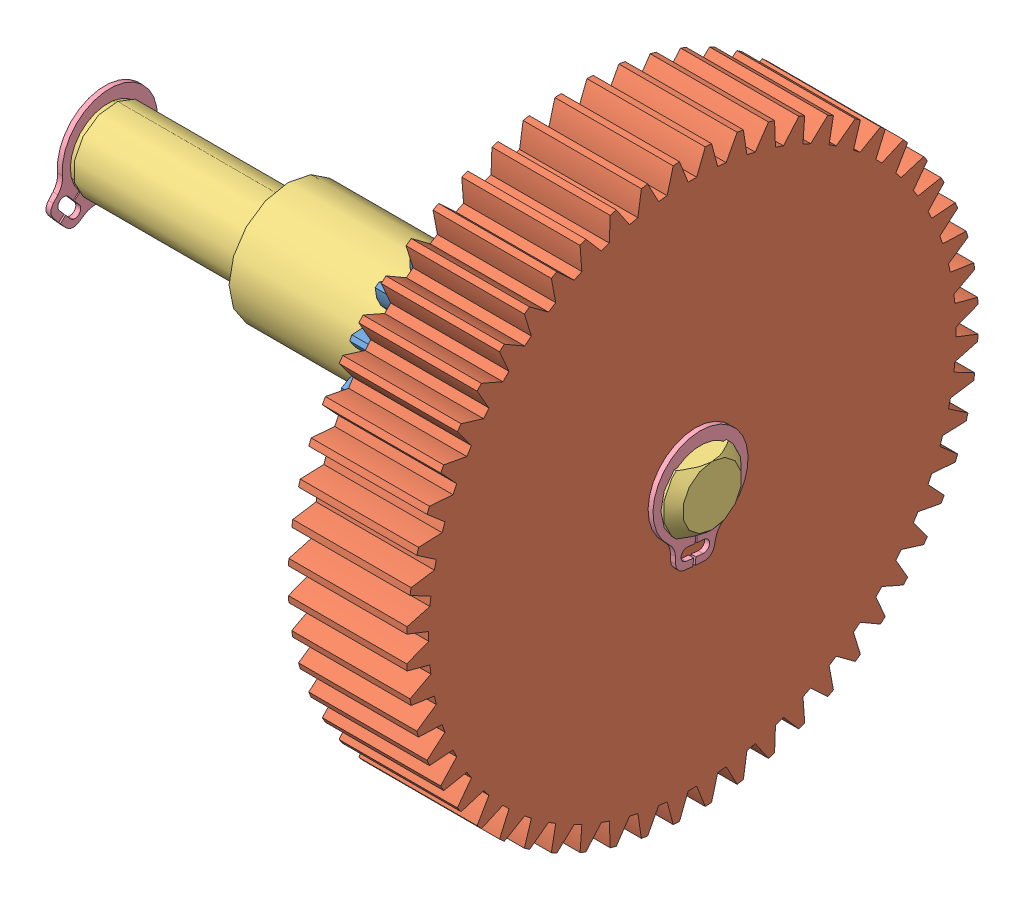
SolidWorks assembly Pignon 4et5.SLDPRT.SLDASM, configuration Défaut (file format 3400). Lengths in mm.
Overall size (31.5 28.97 28.97).
5 component instances, 4 part files, 10 mates.
Components (placement in the parent):
- Pignon 5-1: Pignon 5.SLDPRT [ISO - Spur gear 0.6M 14T 20PA 6FW ---S14A75H50L4.0N] at (-5.1556 1.4493 0) size (7 9.41 9.6)
- Pignon 4-1: Pignon 4.SLDPRT [ISO - Spur gear 0.5M 56T 20PA 6FW ---S56A75H50L4.0N] at (1.8444 1.4493 0) size (6 28.97 28.97)
- Axe pignon 4 et 5-1: Axe pignon 4 et 5.SLDPRT [Défaut] at (-5.1556 1.4493 0) x (0 0 1) z (-1 0 0) size (6 6 31.5)
- cirlips 4-1: cirlips 4.SLDPRT [B27.7M - 3AM1-4] at (7.9944 1.4493 0) x (0 0.096665 0.995317) z (-1 0 0) size (4.82 5.8 0.25)
- cirlips 4-2: cirlips 4.SLDPRT [B27.7M - 3AM1-4] at (-22.0556 1.4493 0) x (0 0.753003 0.658018) z (-1 0 0) size (4.82 5.8 0.25)
Mates (geometry in assembly coordinates):
- Coaxiale1: concentric aligned: cylinder of ?; cylinder of ?
- Coïncidente1: coincident aligned: plane of ?; plane of ?
- Coïncidente3: coincident aligned: plane of ?; plane of ?
- Coaxiale2: concentric aligned: unknown of Axe pignon 4 et 5-1
- Coïncidente4: coincident anti-aligned: unknown of Axe pignon 4 et 5-1
- Coïncidente5: coincident anti-aligned: unknown of Axe pignon 4 et 5-1
- Coaxiale3: concentric aligned: unknown of Axe pignon 4 et 5-1
- Coïncidente6: coincident anti-aligned: unknown of Axe pignon 4 et 5-1
- Coaxiale4: concentric: cylinder of ?; cylinder of ?
- Coïncidente7: coincident = 6 mm anti-aligned: plane of ?; plane of ?
